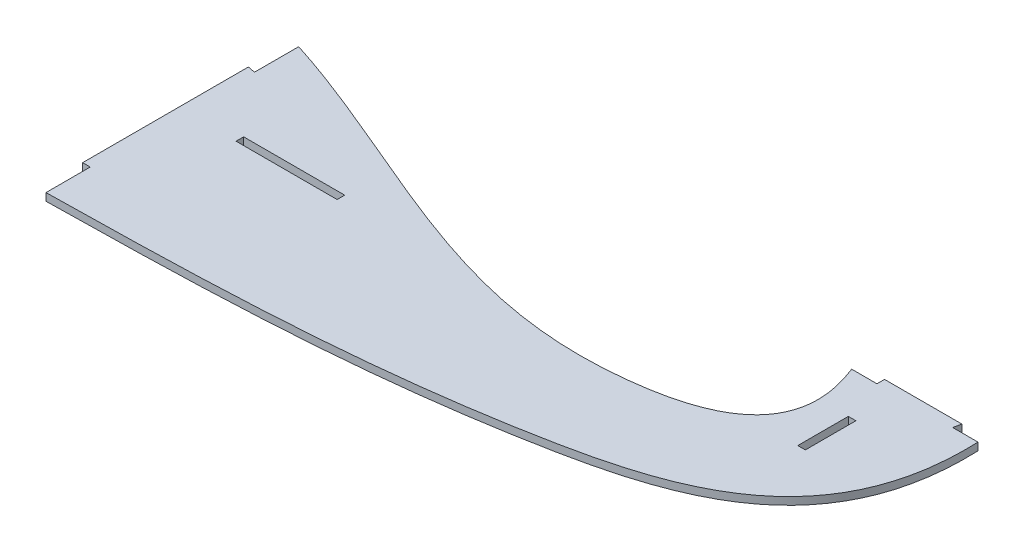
from build123d import *

# Parameters (mm, degrees)
ESQUISSE1_W        = 40
ESQUISSE1_H        = 3
ESQUISSE1_W_2      = 3
ESQUISSE1_H_2      = 20
BOSS_EXTRU_1_DEPTH = 3


with BuildPart() as part:
    # Esquisse1 → Boss.-Extru.1 (new body)
    with BuildSketch(Plane(origin=(0, 0, 0), x_dir=(1, 0, 0), z_dir=(0, 1, 0))):
        with BuildLine():
            Line((-206.035113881, 82.5), (-206.035113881, 65))
            Line((-206.035113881, 65), (-209.035113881, 65.6))
            Line((-209.035113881, 65.6), (-209.035113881, 65))
            Line((-209.035113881, 65), (-209.035113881, 0))
            Line((-209.035113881, 0), (-206.035113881, 0))
            Line((-206.035113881, 0), (-206.035113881, -17.5))
            add(Edge.make_bspline(
                [(-206.035113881, -17.5), (-144.452135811, -16.547858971), (-43.339289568, -14.117353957), (66.368310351, 18.65363483), (63.928148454, 81.402504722)],
                knots=[0, 0, 0, 0, 0.576577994, 1, 1, 1, 1], degree=3))
            Line((63.928148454, 81.402504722), (53.928148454, 81.402504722))
            Line((53.928148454, 81.402504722), (54.528148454, 84.402504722))
            Line((54.528148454, 84.402504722), (53.928148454, 84.402504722))
            Line((53.928148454, 84.402504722), (23.928148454, 84.402504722))
            Line((23.928148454, 84.402504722), (23.928148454, 81.402504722))
            Line((23.928148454, 81.402504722), (13.928148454, 81.402504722))
            add(Edge.make_bspline(
                [(-206.035113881, 82.5), (-161.754644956, 68.504127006), (-103.735826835, 34.150734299), (-17.882556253, 30.440460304), (27.921309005, 46.249992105), (13.928148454, 81.402504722)],
                knots=[0, 0, 0, 0, 0.541162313, 0.723271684, 1, 1, 1, 1], degree=3))
        make_face()
        with Locations((-166.035113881, 39.217348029)):
            Rectangle(ESQUISSE1_W, ESQUISSE1_H, mode=Mode.SUBTRACT)
        with Locations((30.945957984, 54.548045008)):
            Rectangle(ESQUISSE1_W_2, ESQUISSE1_H_2, mode=Mode.SUBTRACT)
    extrude(amount=BOSS_EXTRU_1_DEPTH)


solid = part.part
